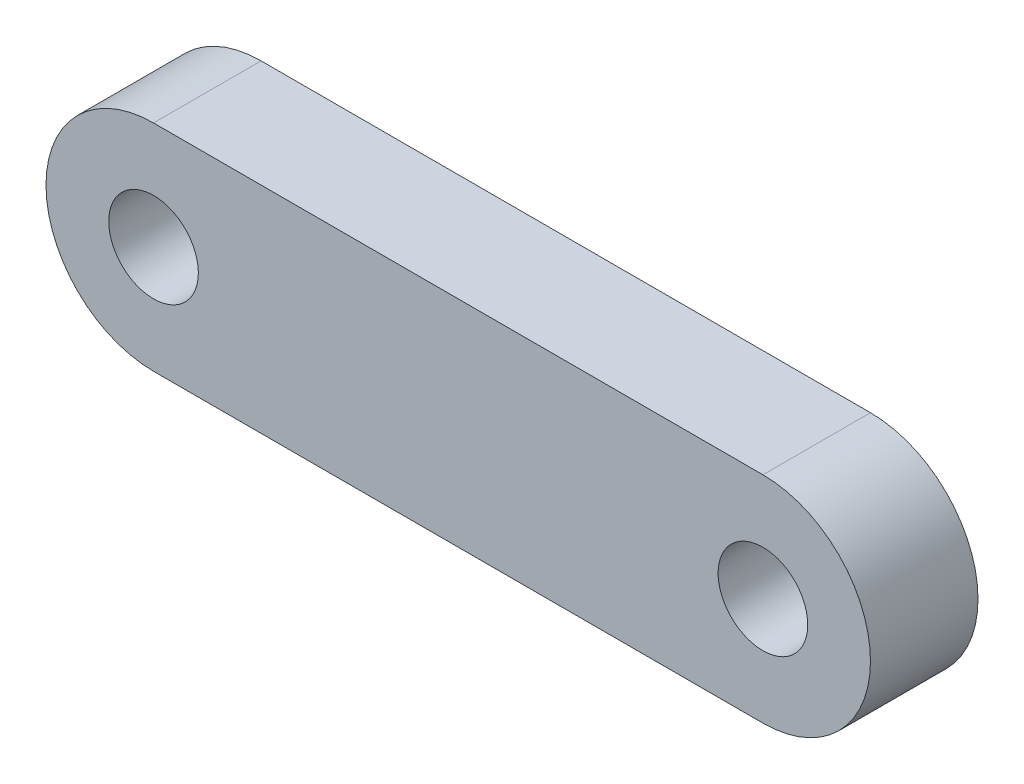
ISO-10303-21;
HEADER;
FILE_DESCRIPTION(('STEP AP214'),'2;1');
FILE_NAME('part.step','',(''),(''),'','','');
FILE_SCHEMA(('AUTOMOTIVE_DESIGN { 1 0 10303 214 1 1 1 1 }'));
ENDSEC;
DATA;
#1=APPLICATION_CONTEXT('core data for automotive mechanical design processes');
#2=APPLICATION_PROTOCOL_DEFINITION('international standard','automotive_design',2000,#1);
#3=PRODUCT_CONTEXT('',#1,'mechanical');
#4=PRODUCT('Part','Part','',(#3));
#5=PRODUCT_RELATED_PRODUCT_CATEGORY('part','',(#4));
#6=PRODUCT_DEFINITION_FORMATION('','',#4);
#7=PRODUCT_DEFINITION_CONTEXT('part definition',#1,'design');
#8=PRODUCT_DEFINITION('design','',#6,#7);
#9=PRODUCT_DEFINITION_SHAPE('','',#8);
#10=(LENGTH_UNIT() NAMED_UNIT(*) SI_UNIT(.MILLI.,.METRE.));
#11=(NAMED_UNIT(*) PLANE_ANGLE_UNIT() SI_UNIT($,.RADIAN.));
#12=(NAMED_UNIT(*) SI_UNIT($,.STERADIAN.) SOLID_ANGLE_UNIT());
#13=UNCERTAINTY_MEASURE_WITH_UNIT(LENGTH_MEASURE(1.E-05),#10,'distance_accuracy_value','');
#14=(GEOMETRIC_REPRESENTATION_CONTEXT(3) GLOBAL_UNCERTAINTY_ASSIGNED_CONTEXT((#13)) GLOBAL_UNIT_ASSIGNED_CONTEXT((#10,
#11,#12)) REPRESENTATION_CONTEXT('',''));
#15=CARTESIAN_POINT('',(0.,0.,0.));
#16=DIRECTION('',(0.,0.,1.));
#17=DIRECTION('',(1.,0.,0.));
#18=AXIS2_PLACEMENT_3D('',#15,#16,#17);
#19=CARTESIAN_POINT('',(0.,0.,3.));
#20=DIRECTION('',(0.,0.,1.));
#21=DIRECTION('',(1.,0.,0.));
#22=AXIS2_PLACEMENT_3D('',#19,#20,#21);
#23=PLANE('',#22);
#24=CARTESIAN_POINT('',(0.,0.,3.));
#25=DIRECTION('',(0.,0.,1.));
#26=DIRECTION('',(1.,0.,0.));
#27=AXIS2_PLACEMENT_3D('',#24,#25,#26);
#28=CIRCLE('',#27,1.25);
#29=CARTESIAN_POINT('',(1.25,0.,3.));
#30=VERTEX_POINT('',#29);
#31=EDGE_CURVE('E116',#30,#30,#28,.T.);
#32=ORIENTED_EDGE('',*,*,#31,.F.);
#33=EDGE_LOOP('',(#32));
#34=FACE_BOUND('',#33,.T.);
#35=CARTESIAN_POINT('',(0.,0.,3.));
#36=DIRECTION('',(0.,0.,1.));
#37=DIRECTION('',(1.,0.,0.));
#38=AXIS2_PLACEMENT_3D('',#35,#36,#37);
#39=CIRCLE('',#38,3.);
#40=CARTESIAN_POINT('',(0.,-3.,3.));
#41=VERTEX_POINT('',#40);
#42=CARTESIAN_POINT('',(0.,3.,3.));
#43=VERTEX_POINT('',#42);
#44=EDGE_CURVE('E96',#41,#43,#39,.T.);
#45=ORIENTED_EDGE('',*,*,#44,.T.);
#46=DIRECTION('',(-1.,0.,0.));
#47=VECTOR('',#46,1.);
#48=CARTESIAN_POINT('',(0.,3.,3.));
#49=LINE('',#48,#47);
#50=CARTESIAN_POINT('',(-17.,3.,3.));
#51=VERTEX_POINT('',#50);
#52=EDGE_CURVE('E91',#43,#51,#49,.T.);
#53=ORIENTED_EDGE('',*,*,#52,.T.);
#54=CARTESIAN_POINT('',(-17.,0.,3.));
#55=DIRECTION('',(0.,0.,1.));
#56=DIRECTION('',(1.,0.,0.));
#57=AXIS2_PLACEMENT_3D('',#54,#55,#56);
#58=CIRCLE('',#57,3.);
#59=CARTESIAN_POINT('',(-17.,-3.,3.));
#60=VERTEX_POINT('',#59);
#61=EDGE_CURVE('E94',#51,#60,#58,.T.);
#62=ORIENTED_EDGE('',*,*,#61,.T.);
#63=DIRECTION('',(1.,0.,0.));
#64=VECTOR('',#63,1.);
#65=CARTESIAN_POINT('',(0.,-3.,3.));
#66=LINE('',#65,#64);
#67=EDGE_CURVE('E61',#60,#41,#66,.T.);
#68=ORIENTED_EDGE('',*,*,#67,.T.);
#69=EDGE_LOOP('',(#45,#53,#62,#68));
#70=FACE_BOUND('',#69,.T.);
#71=CARTESIAN_POINT('',(-17.,0.,3.));
#72=DIRECTION('',(0.,0.,1.));
#73=DIRECTION('',(1.,0.,0.));
#74=AXIS2_PLACEMENT_3D('',#71,#72,#73);
#75=CIRCLE('',#74,1.25);
#76=CARTESIAN_POINT('',(-15.75,0.,3.));
#77=VERTEX_POINT('',#76);
#78=EDGE_CURVE('E138',#77,#77,#75,.T.);
#79=ORIENTED_EDGE('',*,*,#78,.F.);
#80=EDGE_LOOP('',(#79));
#81=FACE_BOUND('',#80,.T.);
#82=ADVANCED_FACE('F43',(#34,#70,#81),#23,.T.);
#83=CARTESIAN_POINT('',(0.,0.,0.));
#84=DIRECTION('',(0.,0.,1.));
#85=DIRECTION('',(1.,0.,0.));
#86=AXIS2_PLACEMENT_3D('',#83,#84,#85);
#87=PLANE('',#86);
#88=CARTESIAN_POINT('',(0.,0.,0.));
#89=DIRECTION('',(0.,0.,1.));
#90=DIRECTION('',(1.,0.,0.));
#91=AXIS2_PLACEMENT_3D('',#88,#89,#90);
#92=CIRCLE('',#91,3.);
#93=CARTESIAN_POINT('',(0.,-3.,0.));
#94=VERTEX_POINT('',#93);
#95=CARTESIAN_POINT('',(0.,3.,0.));
#96=VERTEX_POINT('',#95);
#97=EDGE_CURVE('E112',#94,#96,#92,.T.);
#98=ORIENTED_EDGE('',*,*,#97,.F.);
#99=DIRECTION('',(1.,0.,0.));
#100=VECTOR('',#99,1.);
#101=CARTESIAN_POINT('',(0.,-3.,0.));
#102=LINE('',#101,#100);
#103=CARTESIAN_POINT('',(-17.,-3.,0.));
#104=VERTEX_POINT('',#103);
#105=EDGE_CURVE('E84',#104,#94,#102,.T.);
#106=ORIENTED_EDGE('',*,*,#105,.F.);
#107=CARTESIAN_POINT('',(-17.,0.,0.));
#108=DIRECTION('',(0.,0.,1.));
#109=DIRECTION('',(1.,0.,0.));
#110=AXIS2_PLACEMENT_3D('',#107,#108,#109);
#111=CIRCLE('',#110,3.);
#112=CARTESIAN_POINT('',(-17.,3.,0.));
#113=VERTEX_POINT('',#112);
#114=EDGE_CURVE('E78',#113,#104,#111,.T.);
#115=ORIENTED_EDGE('',*,*,#114,.F.);
#116=DIRECTION('',(-1.,0.,0.));
#117=VECTOR('',#116,1.);
#118=CARTESIAN_POINT('',(0.,3.,0.));
#119=LINE('',#118,#117);
#120=EDGE_CURVE('E101',#96,#113,#119,.T.);
#121=ORIENTED_EDGE('',*,*,#120,.F.);
#122=EDGE_LOOP('',(#98,#106,#115,#121));
#123=FACE_BOUND('',#122,.T.);
#124=CARTESIAN_POINT('',(0.,0.,0.));
#125=DIRECTION('',(0.,0.,1.));
#126=DIRECTION('',(1.,0.,0.));
#127=AXIS2_PLACEMENT_3D('',#124,#125,#126);
#128=CIRCLE('',#127,1.25);
#129=CARTESIAN_POINT('',(1.25,0.,0.));
#130=VERTEX_POINT('',#129);
#131=EDGE_CURVE('E134',#130,#130,#128,.T.);
#132=ORIENTED_EDGE('',*,*,#131,.T.);
#133=EDGE_LOOP('',(#132));
#134=FACE_BOUND('',#133,.T.);
#135=CARTESIAN_POINT('',(-17.,0.,0.));
#136=DIRECTION('',(0.,0.,1.));
#137=DIRECTION('',(1.,0.,0.));
#138=AXIS2_PLACEMENT_3D('',#135,#136,#137);
#139=CIRCLE('',#138,1.25);
#140=CARTESIAN_POINT('',(-15.75,0.,0.));
#141=VERTEX_POINT('',#140);
#142=EDGE_CURVE('E142',#141,#141,#139,.T.);
#143=ORIENTED_EDGE('',*,*,#142,.T.);
#144=EDGE_LOOP('',(#143));
#145=FACE_BOUND('',#144,.T.);
#146=ADVANCED_FACE('F129',(#123,#134,#145),#87,.F.);
#147=CARTESIAN_POINT('',(0.,0.,3.));
#148=DIRECTION('',(0.,0.,-1.));
#149=DIRECTION('',(-1.,0.,0.));
#150=AXIS2_PLACEMENT_3D('',#147,#148,#149);
#151=CYLINDRICAL_SURFACE('',#150,3.);
#152=ORIENTED_EDGE('',*,*,#97,.T.);
#153=DIRECTION('',(0.,0.,-1.));
#154=VECTOR('',#153,1.);
#155=CARTESIAN_POINT('',(0.,3.,3.));
#156=LINE('',#155,#154);
#157=EDGE_CURVE('E11',#43,#96,#156,.T.);
#158=ORIENTED_EDGE('',*,*,#157,.F.);
#159=ORIENTED_EDGE('',*,*,#44,.F.);
#160=DIRECTION('',(0.,0.,-1.));
#161=VECTOR('',#160,1.);
#162=CARTESIAN_POINT('',(0.,-3.,3.));
#163=LINE('',#162,#161);
#164=EDGE_CURVE('E108',#41,#94,#163,.T.);
#165=ORIENTED_EDGE('',*,*,#164,.T.);
#166=EDGE_LOOP('',(#152,#158,#159,#165));
#167=FACE_BOUND('',#166,.T.);
#168=ADVANCED_FACE('F45',(#167),#151,.T.);
#169=CARTESIAN_POINT('',(0.,3.,3.));
#170=DIRECTION('',(0.,-1.,0.));
#171=DIRECTION('',(1.,0.,0.));
#172=AXIS2_PLACEMENT_3D('',#169,#170,#171);
#173=PLANE('',#172);
#174=ORIENTED_EDGE('',*,*,#120,.T.);
#175=DIRECTION('',(0.,0.,-1.));
#176=VECTOR('',#175,1.);
#177=CARTESIAN_POINT('',(-17.,3.,3.));
#178=LINE('',#177,#176);
#179=EDGE_CURVE('E53',#51,#113,#178,.T.);
#180=ORIENTED_EDGE('',*,*,#179,.F.);
#181=ORIENTED_EDGE('',*,*,#52,.F.);
#182=ORIENTED_EDGE('',*,*,#157,.T.);
#183=EDGE_LOOP('',(#174,#180,#181,#182));
#184=FACE_BOUND('',#183,.T.);
#185=ADVANCED_FACE('F100',(#184),#173,.F.);
#186=CARTESIAN_POINT('',(-17.,0.,3.));
#187=DIRECTION('',(0.,0.,-1.));
#188=DIRECTION('',(-1.,0.,0.));
#189=AXIS2_PLACEMENT_3D('',#186,#187,#188);
#190=CYLINDRICAL_SURFACE('',#189,3.);
#191=ORIENTED_EDGE('',*,*,#114,.T.);
#192=DIRECTION('',(0.,0.,-1.));
#193=VECTOR('',#192,1.);
#194=CARTESIAN_POINT('',(-17.,-3.,3.));
#195=LINE('',#194,#193);
#196=EDGE_CURVE('E103',#60,#104,#195,.T.);
#197=ORIENTED_EDGE('',*,*,#196,.F.);
#198=ORIENTED_EDGE('',*,*,#61,.F.);
#199=ORIENTED_EDGE('',*,*,#179,.T.);
#200=EDGE_LOOP('',(#191,#197,#198,#199));
#201=FACE_BOUND('',#200,.T.);
#202=ADVANCED_FACE('F104',(#201),#190,.T.);
#203=CARTESIAN_POINT('',(0.,-3.,3.));
#204=DIRECTION('',(0.,1.,0.));
#205=DIRECTION('',(-1.,0.,0.));
#206=AXIS2_PLACEMENT_3D('',#203,#204,#205);
#207=PLANE('',#206);
#208=ORIENTED_EDGE('',*,*,#105,.T.);
#209=ORIENTED_EDGE('',*,*,#164,.F.);
#210=ORIENTED_EDGE('',*,*,#67,.F.);
#211=ORIENTED_EDGE('',*,*,#196,.T.);
#212=EDGE_LOOP('',(#208,#209,#210,#211));
#213=FACE_BOUND('',#212,.T.);
#214=ADVANCED_FACE('F126',(#213),#207,.F.);
#215=CARTESIAN_POINT('',(0.,0.,3.));
#216=DIRECTION('',(0.,0.,-1.));
#217=DIRECTION('',(-1.,0.,0.));
#218=AXIS2_PLACEMENT_3D('',#215,#216,#217);
#219=CYLINDRICAL_SURFACE('',#218,1.25);
#220=ORIENTED_EDGE('',*,*,#31,.T.);
#221=EDGE_LOOP('',(#220));
#222=FACE_BOUND('',#221,.T.);
#223=ORIENTED_EDGE('',*,*,#131,.F.);
#224=EDGE_LOOP('',(#223));
#225=FACE_BOUND('',#224,.T.);
#226=ADVANCED_FACE('F161',(#222,#225),#219,.F.);
#227=CARTESIAN_POINT('',(-17.,0.,3.));
#228=DIRECTION('',(0.,0.,-1.));
#229=DIRECTION('',(-1.,0.,0.));
#230=AXIS2_PLACEMENT_3D('',#227,#228,#229);
#231=CYLINDRICAL_SURFACE('',#230,1.25);
#232=ORIENTED_EDGE('',*,*,#78,.T.);
#233=EDGE_LOOP('',(#232));
#234=FACE_BOUND('',#233,.T.);
#235=ORIENTED_EDGE('',*,*,#142,.F.);
#236=EDGE_LOOP('',(#235));
#237=FACE_BOUND('',#236,.T.);
#238=ADVANCED_FACE('F150',(#234,#237),#231,.F.);
#239=CLOSED_SHELL('',(#82,#146,#168,#185,#202,#214,#226,#238));
#240=MANIFOLD_SOLID_BREP('B2',#239);
#241=ADVANCED_BREP_SHAPE_REPRESENTATION('',(#18,#240),#14);
#242=SHAPE_DEFINITION_REPRESENTATION(#9,#241);
ENDSEC;
END-ISO-10303-21;
